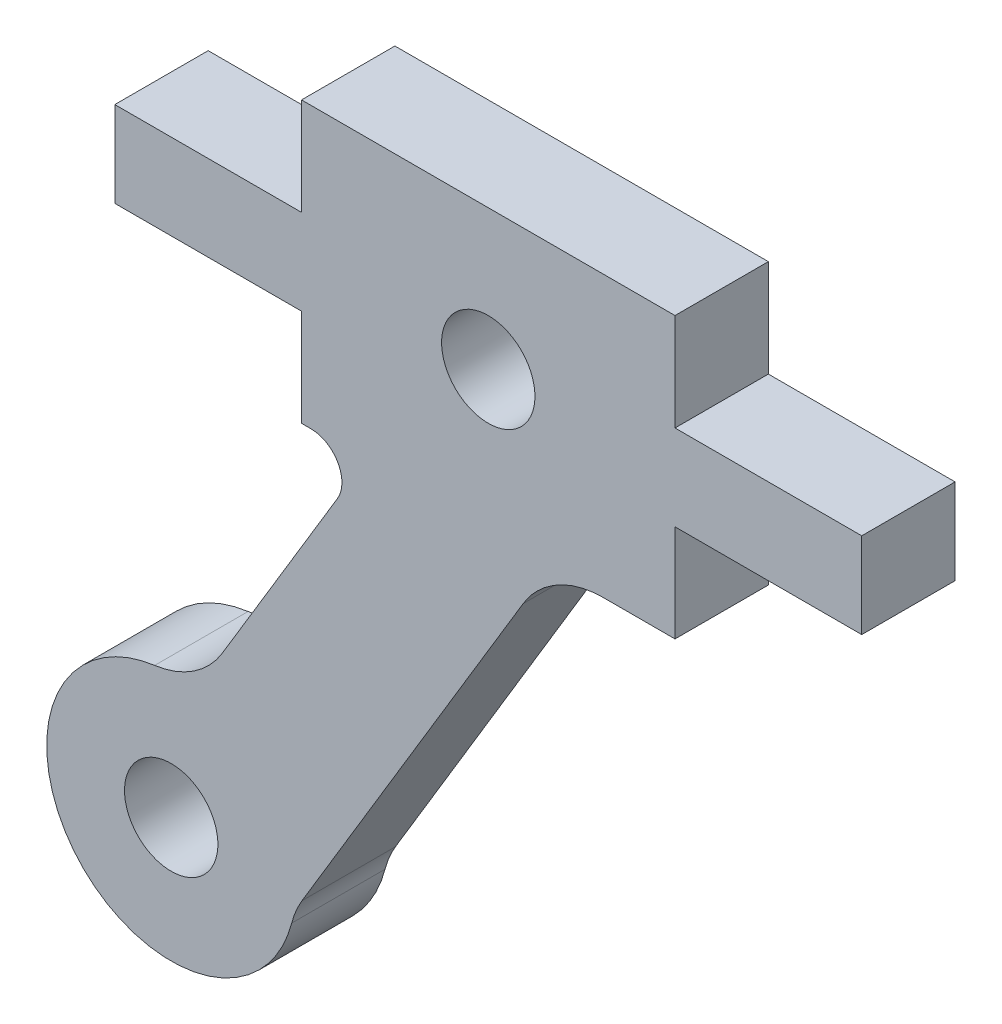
ISO-10303-21;
HEADER;
FILE_DESCRIPTION(('STEP AP214'),'2;1');
FILE_NAME('part.step','',(''),(''),'','','');
FILE_SCHEMA(('AUTOMOTIVE_DESIGN { 1 0 10303 214 1 1 1 1 }'));
ENDSEC;
DATA;
#1=APPLICATION_CONTEXT('core data for automotive mechanical design processes');
#2=APPLICATION_PROTOCOL_DEFINITION('international standard','automotive_design',2000,#1);
#3=PRODUCT_CONTEXT('',#1,'mechanical');
#4=PRODUCT('Part','Part','',(#3));
#5=PRODUCT_RELATED_PRODUCT_CATEGORY('part','',(#4));
#6=PRODUCT_DEFINITION_FORMATION('','',#4);
#7=PRODUCT_DEFINITION_CONTEXT('part definition',#1,'design');
#8=PRODUCT_DEFINITION('design','',#6,#7);
#9=PRODUCT_DEFINITION_SHAPE('','',#8);
#10=(LENGTH_UNIT() NAMED_UNIT(*) SI_UNIT(.MILLI.,.METRE.));
#11=(NAMED_UNIT(*) PLANE_ANGLE_UNIT() SI_UNIT($,.RADIAN.));
#12=(NAMED_UNIT(*) SI_UNIT($,.STERADIAN.) SOLID_ANGLE_UNIT());
#13=UNCERTAINTY_MEASURE_WITH_UNIT(LENGTH_MEASURE(1.E-05),#10,'distance_accuracy_value','');
#14=(GEOMETRIC_REPRESENTATION_CONTEXT(3) GLOBAL_UNCERTAINTY_ASSIGNED_CONTEXT((#13)) GLOBAL_UNIT_ASSIGNED_CONTEXT((#10,
#11,#12)) REPRESENTATION_CONTEXT('',''));
#15=CARTESIAN_POINT('',(0.,0.,0.));
#16=DIRECTION('',(0.,0.,1.));
#17=DIRECTION('',(1.,0.,0.));
#18=AXIS2_PLACEMENT_3D('',#15,#16,#17);
#19=CARTESIAN_POINT('',(4.75049847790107,-6.43548992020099,0.));
#20=DIRECTION('',(0.,0.,-1.));
#21=DIRECTION('',(-1.,0.,0.));
#22=AXIS2_PLACEMENT_3D('',#19,#20,#21);
#23=CYLINDRICAL_SURFACE('',#22,3.);
#24=DIRECTION('',(0.,0.,1.));
#25=VECTOR('',#24,1.);
#26=CARTESIAN_POINT('',(2.17941508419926,-4.88967939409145,0.));
#27=LINE('',#26,#25);
#28=CARTESIAN_POINT('',(2.17941508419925,-4.88967939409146,0.));
#29=VERTEX_POINT('',#28);
#30=CARTESIAN_POINT('',(2.17941508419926,-4.88967939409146,-3.));
#31=VERTEX_POINT('',#30);
#32=EDGE_CURVE('E310',#29,#31,#27,.F.);
#33=ORIENTED_EDGE('',*,*,#32,.T.);
#34=CARTESIAN_POINT('',(4.75049847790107,-6.43548992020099,-3.));
#35=DIRECTION('',(0.,0.,-1.));
#36=DIRECTION('',(-1.,0.,0.));
#37=AXIS2_PLACEMENT_3D('',#34,#35,#36);
#38=CIRCLE('',#37,3.);
#39=CARTESIAN_POINT('',(2.62147831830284,-4.32189744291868,-3.));
#40=VERTEX_POINT('',#39);
#41=EDGE_CURVE('E263',#40,#31,#38,.F.);
#42=ORIENTED_EDGE('',*,*,#41,.F.);
#43=DIRECTION('',(0.,0.,-1.));
#44=VECTOR('',#43,1.);
#45=CARTESIAN_POINT('',(2.62147831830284,-4.32189744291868,0.));
#46=LINE('',#45,#44);
#47=CARTESIAN_POINT('',(2.62147831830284,-4.32189744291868,0.));
#48=VERTEX_POINT('',#47);
#49=EDGE_CURVE('E316',#40,#48,#46,.F.);
#50=ORIENTED_EDGE('',*,*,#49,.T.);
#51=CARTESIAN_POINT('',(4.75049847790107,-6.43548992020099,0.));
#52=DIRECTION('',(0.,0.,-1.));
#53=DIRECTION('',(-1.,0.,0.));
#54=AXIS2_PLACEMENT_3D('',#51,#52,#53);
#55=CIRCLE('',#54,3.);
#56=EDGE_CURVE('E400',#48,#29,#55,.F.);
#57=ORIENTED_EDGE('',*,*,#56,.T.);
#58=EDGE_LOOP('',(#33,#42,#50,#57));
#59=FACE_BOUND('',#58,.T.);
#60=ADVANCED_FACE('F31',(#59),#23,.F.);
#61=CARTESIAN_POINT('',(-2.357043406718,-18.2571734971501,0.));
#62=DIRECTION('',(0.,0.,-1.));
#63=DIRECTION('',(-1.,0.,0.));
#64=AXIS2_PLACEMENT_3D('',#61,#62,#63);
#65=CYLINDRICAL_SURFACE('',#64,3.);
#66=CARTESIAN_POINT('',(-2.357043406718,-18.2571734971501,0.));
#67=DIRECTION('',(0.,0.,-1.));
#68=DIRECTION('',(-1.,0.,0.));
#69=AXIS2_PLACEMENT_3D('',#66,#67,#68);
#70=CIRCLE('',#69,3.);
#71=CARTESIAN_POINT('',(-4.92812680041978,-16.7113629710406,0.));
#72=VERTEX_POINT('',#71);
#73=CARTESIAN_POINT('',(-5.26050047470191,-17.5022317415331,0.));
#74=VERTEX_POINT('',#73);
#75=EDGE_CURVE('E398',#72,#74,#70,.F.);
#76=ORIENTED_EDGE('',*,*,#75,.T.);
#77=DIRECTION('',(0.,0.,-1.));
#78=VECTOR('',#77,1.);
#79=CARTESIAN_POINT('',(-5.26050047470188,-17.5022317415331,0.));
#80=LINE('',#79,#78);
#81=CARTESIAN_POINT('',(-5.26050047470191,-17.5022317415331,-3.));
#82=VERTEX_POINT('',#81);
#83=EDGE_CURVE('E307',#82,#74,#80,.F.);
#84=ORIENTED_EDGE('',*,*,#83,.F.);
#85=CARTESIAN_POINT('',(-2.357043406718,-18.2571734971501,-3.));
#86=DIRECTION('',(0.,0.,-1.));
#87=DIRECTION('',(-1.,0.,0.));
#88=AXIS2_PLACEMENT_3D('',#85,#86,#87);
#89=CIRCLE('',#88,3.);
#90=CARTESIAN_POINT('',(-4.92812680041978,-16.7113629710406,-3.));
#91=VERTEX_POINT('',#90);
#92=EDGE_CURVE('E403',#91,#82,#89,.F.);
#93=ORIENTED_EDGE('',*,*,#92,.F.);
#94=DIRECTION('',(0.,0.,1.));
#95=VECTOR('',#94,1.);
#96=CARTESIAN_POINT('',(-4.92812680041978,-16.7113629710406,0.));
#97=LINE('',#96,#95);
#98=EDGE_CURVE('E314',#91,#72,#97,.T.);
#99=ORIENTED_EDGE('',*,*,#98,.T.);
#100=EDGE_LOOP('',(#76,#84,#93,#99));
#101=FACE_BOUND('',#100,.T.);
#102=ADVANCED_FACE('F693',(#101),#65,.F.);
#103=CARTESIAN_POINT('',(-4.64573100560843,-3.43548992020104,0.));
#104=DIRECTION('',(0.,1.,0.));
#105=DIRECTION('',(-1.,0.,0.));
#106=AXIS2_PLACEMENT_3D('',#103,#104,#105);
#107=PLANE('',#106);
#108=DIRECTION('',(-1.,0.,0.));
#109=VECTOR('',#108,1.);
#110=CARTESIAN_POINT('',(4.75049847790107,-3.43548992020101,0.));
#111=LINE('',#110,#109);
#112=CARTESIAN_POINT('',(-4.64573100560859,-3.435489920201,0.));
#113=VERTEX_POINT('',#112);
#114=CARTESIAN_POINT('',(-4.94320376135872,-3.43548992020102,0.));
#115=VERTEX_POINT('',#114);
#116=EDGE_CURVE('E397',#113,#115,#111,.T.);
#117=ORIENTED_EDGE('',*,*,#116,.T.);
#118=DIRECTION('',(0.,0.,1.));
#119=VECTOR('',#118,1.);
#120=CARTESIAN_POINT('',(-4.94320376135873,-3.43548992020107,0.));
#121=LINE('',#120,#119);
#122=CARTESIAN_POINT('',(-4.94320376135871,-3.43548992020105,-3.));
#123=VERTEX_POINT('',#122);
#124=EDGE_CURVE('E348',#115,#123,#121,.F.);
#125=ORIENTED_EDGE('',*,*,#124,.T.);
#126=DIRECTION('',(-1.,0.,0.));
#127=VECTOR('',#126,1.);
#128=CARTESIAN_POINT('',(-4.64573100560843,-3.43548992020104,-3.));
#129=LINE('',#128,#127);
#130=CARTESIAN_POINT('',(-4.64573100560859,-3.43548992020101,-3.));
#131=VERTEX_POINT('',#130);
#132=EDGE_CURVE('E402',#131,#123,#129,.T.);
#133=ORIENTED_EDGE('',*,*,#132,.F.);
#134=DIRECTION('',(0.,0.,-1.));
#135=VECTOR('',#134,1.);
#136=CARTESIAN_POINT('',(-4.6457310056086,-3.43548992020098,0.));
#137=LINE('',#136,#135);
#138=EDGE_CURVE('E290',#131,#113,#137,.F.);
#139=ORIENTED_EDGE('',*,*,#138,.T.);
#140=EDGE_LOOP('',(#117,#125,#133,#139));
#141=FACE_BOUND('',#140,.T.);
#142=ADVANCED_FACE('F703',(#141),#107,.F.);
#143=CARTESIAN_POINT('',(4.75049847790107,-6.43548992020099,0.));
#144=DIRECTION('',(0.,0.,-1.));
#145=DIRECTION('',(-1.,0.,0.));
#146=AXIS2_PLACEMENT_3D('',#143,#144,#145);
#147=PLANE('',#146);
#148=CARTESIAN_POINT('',(1.05679623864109,1.06451007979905,0.));
#149=DIRECTION('',(0.,0.,-1.));
#150=DIRECTION('',(-1.,0.,0.));
#151=AXIS2_PLACEMENT_3D('',#148,#149,#150);
#152=CIRCLE('',#151,1.49999999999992);
#153=CARTESIAN_POINT('',(2.12130631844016,0.00771384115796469,0.));
#154=VERTEX_POINT('',#153);
#155=CARTESIAN_POINT('',(-0.00771384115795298,2.12130631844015,0.));
#156=VERTEX_POINT('',#155);
#157=EDGE_CURVE('E282',#154,#156,#152,.T.);
#158=ORIENTED_EDGE('',*,*,#157,.T.);
#159=CARTESIAN_POINT('',(1.05679623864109,1.06451007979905,0.));
#160=DIRECTION('',(0.,0.,-1.));
#161=DIRECTION('',(-1.,0.,0.));
#162=AXIS2_PLACEMENT_3D('',#159,#160,#161);
#163=CIRCLE('',#162,1.49999999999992);
#164=EDGE_CURVE('E285',#156,#154,#163,.T.);
#165=ORIENTED_EDGE('',*,*,#164,.T.);
#166=EDGE_LOOP('',(#158,#165));
#167=FACE_BOUND('',#166,.T.);
#168=DIRECTION('',(0.,-1.,0.));
#169=VECTOR('',#168,1.);
#170=CARTESIAN_POINT('',(7.05679623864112,-0.435489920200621,0.));
#171=LINE('',#170,#169);
#172=CARTESIAN_POINT('',(7.05679623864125,-3.43548992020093,0.));
#173=VERTEX_POINT('',#172);
#174=CARTESIAN_POINT('',(7.05679623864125,-0.315,0.));
#175=VERTEX_POINT('',#174);
#176=EDGE_CURVE('E213',#173,#175,#171,.F.);
#177=ORIENTED_EDGE('',*,*,#176,.T.);
#178=DIRECTION('',(-1.,0.,0.));
#179=VECTOR('',#178,1.);
#180=CARTESIAN_POINT('',(7.05679623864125,-0.315,0.));
#181=LINE('',#180,#179);
#182=CARTESIAN_POINT('',(13.0567962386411,-0.315,0.));
#183=VERTEX_POINT('',#182);
#184=EDGE_CURVE('E217',#183,#175,#181,.T.);
#185=ORIENTED_EDGE('',*,*,#184,.F.);
#186=DIRECTION('',(0.,-1.,0.));
#187=VECTOR('',#186,1.);
#188=CARTESIAN_POINT('',(13.0567962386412,2.56451007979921,0.));
#189=LINE('',#188,#187);
#190=CARTESIAN_POINT('',(13.0567962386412,2.435,0.));
#191=VERTEX_POINT('',#190);
#192=EDGE_CURVE('E34',#183,#191,#189,.F.);
#193=ORIENTED_EDGE('',*,*,#192,.T.);
#194=DIRECTION('',(1.,0.,0.));
#195=VECTOR('',#194,1.);
#196=CARTESIAN_POINT('',(7.05679623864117,2.435,0.));
#197=LINE('',#196,#195);
#198=CARTESIAN_POINT('',(7.05679623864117,2.435,0.));
#199=VERTEX_POINT('',#198);
#200=EDGE_CURVE('E232',#199,#191,#197,.T.);
#201=ORIENTED_EDGE('',*,*,#200,.F.);
#202=DIRECTION('',(0.,-1.,0.));
#203=VECTOR('',#202,1.);
#204=CARTESIAN_POINT('',(7.05679623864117,5.56451007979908,0.));
#205=LINE('',#204,#203);
#206=CARTESIAN_POINT('',(7.05679623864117,5.56451007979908,0.));
#207=VERTEX_POINT('',#206);
#208=EDGE_CURVE('E438',#199,#207,#205,.F.);
#209=ORIENTED_EDGE('',*,*,#208,.T.);
#210=DIRECTION('',(1.,0.,0.));
#211=VECTOR('',#210,1.);
#212=CARTESIAN_POINT('',(7.05679623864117,5.56451007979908,0.));
#213=LINE('',#212,#211);
#214=CARTESIAN_POINT('',(-4.94320376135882,5.56451007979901,0.));
#215=VERTEX_POINT('',#214);
#216=EDGE_CURVE('E444',#207,#215,#213,.F.);
#217=ORIENTED_EDGE('',*,*,#216,.T.);
#218=DIRECTION('',(0.,1.,0.));
#219=VECTOR('',#218,1.);
#220=CARTESIAN_POINT('',(-4.94320376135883,5.564510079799,0.));
#221=LINE('',#220,#219);
#222=CARTESIAN_POINT('',(-4.94320376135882,2.435,0.));
#223=VERTEX_POINT('',#222);
#224=EDGE_CURVE('E340',#215,#223,#221,.F.);
#225=ORIENTED_EDGE('',*,*,#224,.T.);
#226=DIRECTION('',(1.,0.,0.));
#227=VECTOR('',#226,1.);
#228=CARTESIAN_POINT('',(-4.94320376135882,2.435,0.));
#229=LINE('',#228,#227);
#230=CARTESIAN_POINT('',(-10.9432037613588,2.435,0.));
#231=VERTEX_POINT('',#230);
#232=EDGE_CURVE('E242',#231,#223,#229,.T.);
#233=ORIENTED_EDGE('',*,*,#232,.F.);
#234=DIRECTION('',(0.,1.,0.));
#235=VECTOR('',#234,1.);
#236=CARTESIAN_POINT('',(-10.9432037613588,2.56451007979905,0.));
#237=LINE('',#236,#235);
#238=CARTESIAN_POINT('',(-10.9432037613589,-0.315,0.));
#239=VERTEX_POINT('',#238);
#240=EDGE_CURVE('E337',#231,#239,#237,.F.);
#241=ORIENTED_EDGE('',*,*,#240,.T.);
#242=DIRECTION('',(-1.,0.,0.));
#243=VECTOR('',#242,1.);
#244=CARTESIAN_POINT('',(-4.94320376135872,-0.315,0.));
#245=LINE('',#244,#243);
#246=CARTESIAN_POINT('',(-4.94320376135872,-0.315,0.));
#247=VERTEX_POINT('',#246);
#248=EDGE_CURVE('E251',#247,#239,#245,.T.);
#249=ORIENTED_EDGE('',*,*,#248,.F.);
#250=DIRECTION('',(0.,1.,0.));
#251=VECTOR('',#250,1.);
#252=CARTESIAN_POINT('',(-4.94320376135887,-0.435489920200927,0.));
#253=LINE('',#252,#251);
#254=EDGE_CURVE('E288',#247,#115,#253,.F.);
#255=ORIENTED_EDGE('',*,*,#254,.T.);
#256=ORIENTED_EDGE('',*,*,#116,.F.);
#257=CARTESIAN_POINT('',(-4.64573100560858,-4.43548992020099,0.));
#258=DIRECTION('',(0.,0.,-1.));
#259=DIRECTION('',(-1.,0.,0.));
#260=AXIS2_PLACEMENT_3D('',#257,#258,#259);
#261=CIRCLE('',#260,1.);
#262=CARTESIAN_POINT('',(-3.78874025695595,-4.95082171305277,0.));
#263=VERTEX_POINT('',#262);
#264=EDGE_CURVE('E289',#113,#263,#261,.T.);
#265=ORIENTED_EDGE('',*,*,#264,.T.);
#266=DIRECTION('',(0.515331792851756,0.85699074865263,0.));
#267=VECTOR('',#266,1.);
#268=CARTESIAN_POINT('',(-7.4884374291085,-11.1033748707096,0.));
#269=LINE('',#268,#267);
#270=CARTESIAN_POINT('',(-7.48843742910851,-11.1033748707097,0.));
#271=VERTEX_POINT('',#270);
#272=EDGE_CURVE('E294',#263,#271,#269,.F.);
#273=ORIENTED_EDGE('',*,*,#272,.T.);
#274=CARTESIAN_POINT('',(-10.0594096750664,-9.55737949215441,0.));
#275=DIRECTION('',(0.,0.,-1.));
#276=DIRECTION('',(-1.,0.,0.));
#277=AXIS2_PLACEMENT_3D('',#274,#275,#276);
#278=CIRCLE('',#277,3.);
#279=CARTESIAN_POINT('',(-9.66185262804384,-12.5309208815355,0.));
#280=VERTEX_POINT('',#279);
#281=EDGE_CURVE('E297',#271,#280,#278,.T.);
#282=ORIENTED_EDGE('',*,*,#281,.T.);
#283=CARTESIAN_POINT('',(-9.1317765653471,-16.4956427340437,0.));
#284=DIRECTION('',(0.,0.,-1.));
#285=DIRECTION('',(-1.,0.,0.));
#286=AXIS2_PLACEMENT_3D('',#283,#284,#285);
#287=CIRCLE('',#286,3.99999999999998);
#288=CARTESIAN_POINT('',(-11.970470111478,-13.6775194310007,0.));
#289=VERTEX_POINT('',#288);
#290=EDGE_CURVE('E301',#289,#280,#287,.T.);
#291=ORIENTED_EDGE('',*,*,#290,.F.);
#292=CARTESIAN_POINT('',(-9.1317765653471,-16.4956427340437,0.));
#293=DIRECTION('',(0.,0.,-1.));
#294=DIRECTION('',(-1.,0.,0.));
#295=AXIS2_PLACEMENT_3D('',#292,#293,#294);
#296=CIRCLE('',#295,3.99999999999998);
#297=CARTESIAN_POINT('',(-6.29308301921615,-19.3137660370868,0.));
#298=VERTEX_POINT('',#297);
#299=EDGE_CURVE('E302',#298,#289,#296,.T.);
#300=ORIENTED_EDGE('',*,*,#299,.F.);
#301=CARTESIAN_POINT('',(-9.1317765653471,-16.4956427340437,0.));
#302=DIRECTION('',(0.,0.,-1.));
#303=DIRECTION('',(-1.,0.,0.));
#304=AXIS2_PLACEMENT_3D('',#301,#302,#303);
#305=CIRCLE('',#304,3.99999999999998);
#306=EDGE_CURVE('E306',#74,#298,#305,.T.);
#307=ORIENTED_EDGE('',*,*,#306,.F.);
#308=ORIENTED_EDGE('',*,*,#75,.F.);
#309=DIRECTION('',(-0.515270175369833,-0.857027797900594,0.));
#310=VECTOR('',#309,1.);
#311=CARTESIAN_POINT('',(-4.92812680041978,-16.7113629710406,0.));
#312=LINE('',#311,#310);
#313=EDGE_CURVE('E313',#72,#29,#312,.F.);
#314=ORIENTED_EDGE('',*,*,#313,.T.);
#315=ORIENTED_EDGE('',*,*,#56,.F.);
#316=CARTESIAN_POINT('',(4.75049847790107,-6.43548992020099,0.));
#317=DIRECTION('',(0.,0.,-1.));
#318=DIRECTION('',(-1.,0.,0.));
#319=AXIS2_PLACEMENT_3D('',#316,#317,#318);
#320=CIRCLE('',#319,3.);
#321=CARTESIAN_POINT('',(4.75049847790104,-3.43548992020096,0.));
#322=VERTEX_POINT('',#321);
#323=EDGE_CURVE('E319',#48,#322,#320,.T.);
#324=ORIENTED_EDGE('',*,*,#323,.T.);
#325=DIRECTION('',(-1.,0.,0.));
#326=VECTOR('',#325,1.);
#327=CARTESIAN_POINT('',(7.05679623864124,-3.43548992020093,0.));
#328=LINE('',#327,#326);
#329=EDGE_CURVE('E220',#322,#173,#328,.F.);
#330=ORIENTED_EDGE('',*,*,#329,.T.);
#331=EDGE_LOOP('',(#177,#185,#193,#201,#209,#217,#225,#233,#241,#249,#255,#256,#265,#273,#282,
#291,#300,#307,#308,#314,#315,#324,#330));
#332=FACE_BOUND('',#331,.T.);
#333=CARTESIAN_POINT('',(-9.1317765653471,-16.4956427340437,0.));
#334=DIRECTION('',(0.,0.,-1.));
#335=DIRECTION('',(-1.,0.,0.));
#336=AXIS2_PLACEMENT_3D('',#333,#334,#335);
#337=CIRCLE('',#336,1.5);
#338=CARTESIAN_POINT('',(-8.06726648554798,-17.5524389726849,0.));
#339=VERTEX_POINT('',#338);
#340=CARTESIAN_POINT('',(-10.1962866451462,-15.4388464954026,0.));
#341=VERTEX_POINT('',#340);
#342=EDGE_CURVE('E394',#339,#341,#337,.T.);
#343=ORIENTED_EDGE('',*,*,#342,.T.);
#344=CARTESIAN_POINT('',(-9.1317765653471,-16.4956427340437,0.));
#345=DIRECTION('',(0.,0.,-1.));
#346=DIRECTION('',(-1.,0.,0.));
#347=AXIS2_PLACEMENT_3D('',#344,#345,#346);
#348=CIRCLE('',#347,1.5);
#349=EDGE_CURVE('E341',#341,#339,#348,.T.);
#350=ORIENTED_EDGE('',*,*,#349,.T.);
#351=EDGE_LOOP('',(#343,#350));
#352=FACE_BOUND('',#351,.T.);
#353=ADVANCED_FACE('F215',(#167,#332,#352),#147,.F.);
#354=CARTESIAN_POINT('',(-9.1317765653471,-16.4956427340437,0.));
#355=DIRECTION('',(0.,0.,-1.));
#356=DIRECTION('',(-1.,0.,0.));
#357=AXIS2_PLACEMENT_3D('',#354,#355,#356);
#358=CYLINDRICAL_SURFACE('',#357,1.5);
#359=CARTESIAN_POINT('',(-9.1317765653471,-16.4956427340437,-3.));
#360=DIRECTION('',(0.,0.,-1.));
#361=DIRECTION('',(-1.,0.,0.));
#362=AXIS2_PLACEMENT_3D('',#359,#360,#361);
#363=CIRCLE('',#362,1.5);
#364=CARTESIAN_POINT('',(-10.1962866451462,-15.4388464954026,-3.));
#365=VERTEX_POINT('',#364);
#366=CARTESIAN_POINT('',(-8.06726648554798,-17.5524389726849,-3.));
#367=VERTEX_POINT('',#366);
#368=EDGE_CURVE('E378',#365,#367,#363,.F.);
#369=ORIENTED_EDGE('',*,*,#368,.F.);
#370=DIRECTION('',(0.,0.,-1.));
#371=VECTOR('',#370,1.);
#372=CARTESIAN_POINT('',(-10.1962866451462,-15.4388464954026,0.));
#373=LINE('',#372,#371);
#374=EDGE_CURVE('E393',#365,#341,#373,.F.);
#375=ORIENTED_EDGE('',*,*,#374,.T.);
#376=ORIENTED_EDGE('',*,*,#342,.F.);
#377=DIRECTION('',(0.,0.,-1.));
#378=VECTOR('',#377,1.);
#379=CARTESIAN_POINT('',(-8.06726648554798,-17.5524389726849,0.));
#380=LINE('',#379,#378);
#381=EDGE_CURVE('E396',#339,#367,#380,.T.);
#382=ORIENTED_EDGE('',*,*,#381,.T.);
#383=EDGE_LOOP('',(#369,#375,#376,#382));
#384=FACE_BOUND('',#383,.T.);
#385=ADVANCED_FACE('F721',(#384),#358,.F.);
#386=CARTESIAN_POINT('',(-9.1317765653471,-16.4956427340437,0.));
#387=DIRECTION('',(0.,0.,-1.));
#388=DIRECTION('',(-1.,0.,0.));
#389=AXIS2_PLACEMENT_3D('',#386,#387,#388);
#390=CYLINDRICAL_SURFACE('',#389,1.5);
#391=ORIENTED_EDGE('',*,*,#374,.F.);
#392=CARTESIAN_POINT('',(-9.1317765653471,-16.4956427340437,-3.));
#393=DIRECTION('',(0.,0.,-1.));
#394=DIRECTION('',(-1.,0.,0.));
#395=AXIS2_PLACEMENT_3D('',#392,#393,#394);
#396=CIRCLE('',#395,1.5);
#397=EDGE_CURVE('E374',#367,#365,#396,.F.);
#398=ORIENTED_EDGE('',*,*,#397,.F.);
#399=ORIENTED_EDGE('',*,*,#381,.F.);
#400=ORIENTED_EDGE('',*,*,#349,.F.);
#401=EDGE_LOOP('',(#391,#398,#399,#400));
#402=FACE_BOUND('',#401,.T.);
#403=ADVANCED_FACE('F729',(#402),#390,.F.);
#404=CARTESIAN_POINT('',(-10.9432037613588,2.56451007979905,0.));
#405=DIRECTION('',(1.,0.,0.));
#406=DIRECTION('',(0.,1.,0.));
#407=AXIS2_PLACEMENT_3D('',#404,#405,#406);
#408=PLANE('',#407);
#409=ORIENTED_EDGE('',*,*,#240,.F.);
#410=DIRECTION('',(0.,0.,-1.));
#411=VECTOR('',#410,1.);
#412=CARTESIAN_POINT('',(-10.9432037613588,2.435,0.));
#413=LINE('',#412,#411);
#414=CARTESIAN_POINT('',(-10.9432037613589,2.435,-3.));
#415=VERTEX_POINT('',#414);
#416=EDGE_CURVE('E248',#231,#415,#413,.T.);
#417=ORIENTED_EDGE('',*,*,#416,.T.);
#418=DIRECTION('',(0.,1.,0.));
#419=VECTOR('',#418,1.);
#420=CARTESIAN_POINT('',(-10.9432037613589,-6.43548992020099,-3.));
#421=LINE('',#420,#419);
#422=CARTESIAN_POINT('',(-10.9432037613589,-0.315,-3.));
#423=VERTEX_POINT('',#422);
#424=EDGE_CURVE('E377',#423,#415,#421,.T.);
#425=ORIENTED_EDGE('',*,*,#424,.F.);
#426=DIRECTION('',(0.,0.,1.));
#427=VECTOR('',#426,1.);
#428=CARTESIAN_POINT('',(-10.9432037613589,-0.315,0.));
#429=LINE('',#428,#427);
#430=EDGE_CURVE('E260',#423,#239,#429,.T.);
#431=ORIENTED_EDGE('',*,*,#430,.T.);
#432=EDGE_LOOP('',(#409,#417,#425,#431));
#433=FACE_BOUND('',#432,.T.);
#434=ADVANCED_FACE('F494',(#433),#408,.F.);
#435=CARTESIAN_POINT('',(-4.94320376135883,5.564510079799,0.));
#436=DIRECTION('',(1.,0.,0.));
#437=DIRECTION('',(0.,1.,0.));
#438=AXIS2_PLACEMENT_3D('',#435,#436,#437);
#439=PLANE('',#438);
#440=ORIENTED_EDGE('',*,*,#224,.F.);
#441=DIRECTION('',(0.,0.,1.));
#442=VECTOR('',#441,1.);
#443=CARTESIAN_POINT('',(-4.94320376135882,5.56451007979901,0.));
#444=LINE('',#443,#442);
#445=CARTESIAN_POINT('',(-4.94320376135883,5.564510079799,-3.));
#446=VERTEX_POINT('',#445);
#447=EDGE_CURVE('E441',#215,#446,#444,.F.);
#448=ORIENTED_EDGE('',*,*,#447,.T.);
#449=DIRECTION('',(0.,1.,0.));
#450=VECTOR('',#449,1.);
#451=CARTESIAN_POINT('',(-4.94320376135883,-6.43548992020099,-3.));
#452=LINE('',#451,#450);
#453=CARTESIAN_POINT('',(-4.94320376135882,2.435,-3.));
#454=VERTEX_POINT('',#453);
#455=EDGE_CURVE('E407',#454,#446,#452,.T.);
#456=ORIENTED_EDGE('',*,*,#455,.F.);
#457=DIRECTION('',(0.,0.,1.));
#458=VECTOR('',#457,1.);
#459=CARTESIAN_POINT('',(-4.94320376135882,2.435,-3.));
#460=LINE('',#459,#458);
#461=EDGE_CURVE('E245',#454,#223,#460,.T.);
#462=ORIENTED_EDGE('',*,*,#461,.T.);
#463=EDGE_LOOP('',(#440,#448,#456,#462));
#464=FACE_BOUND('',#463,.T.);
#465=ADVANCED_FACE('F457',(#464),#439,.F.);
#466=CARTESIAN_POINT('',(7.05679623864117,5.56451007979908,0.));
#467=DIRECTION('',(0.,-1.,0.));
#468=DIRECTION('',(1.,0.,0.));
#469=AXIS2_PLACEMENT_3D('',#466,#467,#468);
#470=PLANE('',#469);
#471=ORIENTED_EDGE('',*,*,#216,.F.);
#472=DIRECTION('',(0.,0.,1.));
#473=VECTOR('',#472,1.);
#474=CARTESIAN_POINT('',(7.05679623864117,5.56451007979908,0.));
#475=LINE('',#474,#473);
#476=CARTESIAN_POINT('',(7.05679623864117,5.56451007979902,-3.));
#477=VERTEX_POINT('',#476);
#478=EDGE_CURVE('E440',#207,#477,#475,.F.);
#479=ORIENTED_EDGE('',*,*,#478,.T.);
#480=DIRECTION('',(-1.,0.,0.));
#481=VECTOR('',#480,1.);
#482=CARTESIAN_POINT('',(4.75049847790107,5.564510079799,-3.));
#483=LINE('',#482,#481);
#484=EDGE_CURVE('E462',#446,#477,#483,.F.);
#485=ORIENTED_EDGE('',*,*,#484,.F.);
#486=ORIENTED_EDGE('',*,*,#447,.F.);
#487=EDGE_LOOP('',(#471,#479,#485,#486));
#488=FACE_BOUND('',#487,.T.);
#489=ADVANCED_FACE('F486',(#488),#470,.F.);
#490=CARTESIAN_POINT('',(7.05679623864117,5.56451007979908,0.));
#491=DIRECTION('',(-1.,0.,0.));
#492=DIRECTION('',(0.,-1.,0.));
#493=AXIS2_PLACEMENT_3D('',#490,#491,#492);
#494=PLANE('',#493);
#495=ORIENTED_EDGE('',*,*,#208,.F.);
#496=DIRECTION('',(0.,0.,1.));
#497=VECTOR('',#496,1.);
#498=CARTESIAN_POINT('',(7.05679623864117,2.435,-3.));
#499=LINE('',#498,#497);
#500=CARTESIAN_POINT('',(7.05679623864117,2.435,-3.));
#501=VERTEX_POINT('',#500);
#502=EDGE_CURVE('E237',#501,#199,#499,.T.);
#503=ORIENTED_EDGE('',*,*,#502,.F.);
#504=DIRECTION('',(0.,1.,0.));
#505=VECTOR('',#504,1.);
#506=CARTESIAN_POINT('',(7.05679623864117,-6.43548992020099,-3.));
#507=LINE('',#506,#505);
#508=EDGE_CURVE('E332',#477,#501,#507,.F.);
#509=ORIENTED_EDGE('',*,*,#508,.F.);
#510=ORIENTED_EDGE('',*,*,#478,.F.);
#511=EDGE_LOOP('',(#495,#503,#509,#510));
#512=FACE_BOUND('',#511,.T.);
#513=ADVANCED_FACE('F485',(#512),#494,.F.);
#514=CARTESIAN_POINT('',(13.0567962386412,2.56451007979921,0.));
#515=DIRECTION('',(-1.,0.,0.));
#516=DIRECTION('',(0.,-1.,0.));
#517=AXIS2_PLACEMENT_3D('',#514,#515,#516);
#518=PLANE('',#517);
#519=ORIENTED_EDGE('',*,*,#192,.F.);
#520=DIRECTION('',(0.,0.,-1.));
#521=VECTOR('',#520,1.);
#522=CARTESIAN_POINT('',(13.0567962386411,-0.315,0.));
#523=LINE('',#522,#521);
#524=CARTESIAN_POINT('',(13.0567962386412,-0.315,-3.));
#525=VERTEX_POINT('',#524);
#526=EDGE_CURVE('E228',#183,#525,#523,.T.);
#527=ORIENTED_EDGE('',*,*,#526,.T.);
#528=DIRECTION('',(0.,1.,0.));
#529=VECTOR('',#528,1.);
#530=CARTESIAN_POINT('',(13.0567962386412,-6.43548992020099,-3.));
#531=LINE('',#530,#529);
#532=CARTESIAN_POINT('',(13.0567962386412,2.435,-3.));
#533=VERTEX_POINT('',#532);
#534=EDGE_CURVE('E327',#533,#525,#531,.F.);
#535=ORIENTED_EDGE('',*,*,#534,.F.);
#536=DIRECTION('',(0.,0.,1.));
#537=VECTOR('',#536,1.);
#538=CARTESIAN_POINT('',(13.0567962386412,2.435,0.));
#539=LINE('',#538,#537);
#540=EDGE_CURVE('E55',#533,#191,#539,.T.);
#541=ORIENTED_EDGE('',*,*,#540,.T.);
#542=EDGE_LOOP('',(#519,#527,#535,#541));
#543=FACE_BOUND('',#542,.T.);
#544=ADVANCED_FACE('F481',(#543),#518,.F.);
#545=CARTESIAN_POINT('',(7.05679623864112,-0.435489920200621,0.));
#546=DIRECTION('',(-1.,0.,0.));
#547=DIRECTION('',(0.,-1.,0.));
#548=AXIS2_PLACEMENT_3D('',#545,#546,#547);
#549=PLANE('',#548);
#550=ORIENTED_EDGE('',*,*,#176,.F.);
#551=DIRECTION('',(0.,0.,1.));
#552=VECTOR('',#551,1.);
#553=CARTESIAN_POINT('',(7.05679623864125,-3.43548992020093,0.));
#554=LINE('',#553,#552);
#555=CARTESIAN_POINT('',(7.05679623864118,-3.43548992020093,-3.));
#556=VERTEX_POINT('',#555);
#557=EDGE_CURVE('E322',#173,#556,#554,.F.);
#558=ORIENTED_EDGE('',*,*,#557,.T.);
#559=DIRECTION('',(0.,1.,0.));
#560=VECTOR('',#559,1.);
#561=CARTESIAN_POINT('',(7.05679623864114,-6.43548992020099,-3.));
#562=LINE('',#561,#560);
#563=CARTESIAN_POINT('',(7.05679623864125,-0.315,-3.));
#564=VERTEX_POINT('',#563);
#565=EDGE_CURVE('E47',#564,#556,#562,.F.);
#566=ORIENTED_EDGE('',*,*,#565,.F.);
#567=DIRECTION('',(0.,0.,1.));
#568=VECTOR('',#567,1.);
#569=CARTESIAN_POINT('',(7.05679623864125,-0.315,-3.));
#570=LINE('',#569,#568);
#571=EDGE_CURVE('E225',#564,#175,#570,.T.);
#572=ORIENTED_EDGE('',*,*,#571,.T.);
#573=EDGE_LOOP('',(#550,#558,#566,#572));
#574=FACE_BOUND('',#573,.T.);
#575=ADVANCED_FACE('F230',(#574),#549,.F.);
#576=CARTESIAN_POINT('',(7.05679623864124,-3.43548992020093,0.));
#577=DIRECTION('',(0.,1.,0.));
#578=DIRECTION('',(-1.,0.,0.));
#579=AXIS2_PLACEMENT_3D('',#576,#577,#578);
#580=PLANE('',#579);
#581=ORIENTED_EDGE('',*,*,#329,.F.);
#582=DIRECTION('',(0.,0.,-1.));
#583=VECTOR('',#582,1.);
#584=CARTESIAN_POINT('',(4.75049847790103,-3.43548992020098,0.));
#585=LINE('',#584,#583);
#586=CARTESIAN_POINT('',(4.75049847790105,-3.43548992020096,-3.));
#587=VERTEX_POINT('',#586);
#588=EDGE_CURVE('E317',#322,#587,#585,.T.);
#589=ORIENTED_EDGE('',*,*,#588,.T.);
#590=DIRECTION('',(-1.,0.,0.));
#591=VECTOR('',#590,1.);
#592=CARTESIAN_POINT('',(4.75049847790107,-3.43548992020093,-3.));
#593=LINE('',#592,#591);
#594=EDGE_CURVE('E274',#556,#587,#593,.T.);
#595=ORIENTED_EDGE('',*,*,#594,.F.);
#596=ORIENTED_EDGE('',*,*,#557,.F.);
#597=EDGE_LOOP('',(#581,#589,#595,#596));
#598=FACE_BOUND('',#597,.T.);
#599=ADVANCED_FACE('F549',(#598),#580,.F.);
#600=CARTESIAN_POINT('',(4.75049847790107,-6.43548992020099,0.));
#601=DIRECTION('',(0.,0.,-1.));
#602=DIRECTION('',(-1.,0.,0.));
#603=AXIS2_PLACEMENT_3D('',#600,#601,#602);
#604=CYLINDRICAL_SURFACE('',#603,3.);
#605=CARTESIAN_POINT('',(4.75049847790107,-6.43548992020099,-3.));
#606=DIRECTION('',(0.,0.,-1.));
#607=DIRECTION('',(-1.,0.,0.));
#608=AXIS2_PLACEMENT_3D('',#605,#606,#607);
#609=CIRCLE('',#608,3.);
#610=EDGE_CURVE('E273',#587,#40,#609,.F.);
#611=ORIENTED_EDGE('',*,*,#610,.F.);
#612=ORIENTED_EDGE('',*,*,#588,.F.);
#613=ORIENTED_EDGE('',*,*,#323,.F.);
#614=ORIENTED_EDGE('',*,*,#49,.F.);
#615=EDGE_LOOP('',(#611,#612,#613,#614));
#616=FACE_BOUND('',#615,.T.);
#617=ADVANCED_FACE('F545',(#616),#604,.F.);
#618=CARTESIAN_POINT('',(-4.92812680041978,-16.7113629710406,0.));
#619=DIRECTION('',(-0.857027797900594,0.515270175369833,0.));
#620=DIRECTION('',(-0.515270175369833,-0.857027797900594,0.));
#621=AXIS2_PLACEMENT_3D('',#618,#619,#620);
#622=PLANE('',#621);
#623=ORIENTED_EDGE('',*,*,#313,.F.);
#624=ORIENTED_EDGE('',*,*,#98,.F.);
#625=DIRECTION('',(-0.515270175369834,-0.857027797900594,0.));
#626=VECTOR('',#625,1.);
#627=CARTESIAN_POINT('',(2.17941508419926,-4.88967939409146,-3.));
#628=LINE('',#627,#626);
#629=EDGE_CURVE('E269',#31,#91,#628,.T.);
#630=ORIENTED_EDGE('',*,*,#629,.F.);
#631=ORIENTED_EDGE('',*,*,#32,.F.);
#632=EDGE_LOOP('',(#623,#624,#630,#631));
#633=FACE_BOUND('',#632,.T.);
#634=ADVANCED_FACE('F541',(#633),#622,.F.);
#635=CARTESIAN_POINT('',(-9.1317765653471,-16.4956427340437,0.));
#636=DIRECTION('',(0.,0.,-1.));
#637=DIRECTION('',(-1.,0.,0.));
#638=AXIS2_PLACEMENT_3D('',#635,#636,#637);
#639=CYLINDRICAL_SURFACE('',#638,3.99999999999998);
#640=ORIENTED_EDGE('',*,*,#306,.T.);
#641=DIRECTION('',(0.,0.,-1.));
#642=VECTOR('',#641,1.);
#643=CARTESIAN_POINT('',(-6.29308301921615,-19.3137660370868,0.));
#644=LINE('',#643,#642);
#645=CARTESIAN_POINT('',(-6.29308301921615,-19.3137660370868,-3.));
#646=VERTEX_POINT('',#645);
#647=EDGE_CURVE('E303',#646,#298,#644,.F.);
#648=ORIENTED_EDGE('',*,*,#647,.F.);
#649=CARTESIAN_POINT('',(-9.1317765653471,-16.4956427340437,-3.));
#650=DIRECTION('',(0.,0.,-1.));
#651=DIRECTION('',(-1.,0.,0.));
#652=AXIS2_PLACEMENT_3D('',#649,#650,#651);
#653=CIRCLE('',#652,3.99999999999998);
#654=EDGE_CURVE('E272',#82,#646,#653,.T.);
#655=ORIENTED_EDGE('',*,*,#654,.F.);
#656=ORIENTED_EDGE('',*,*,#83,.T.);
#657=EDGE_LOOP('',(#640,#648,#655,#656));
#658=FACE_BOUND('',#657,.T.);
#659=ADVANCED_FACE('F537',(#658),#639,.T.);
#660=CARTESIAN_POINT('',(-9.1317765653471,-16.4956427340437,0.));
#661=DIRECTION('',(0.,0.,-1.));
#662=DIRECTION('',(-1.,0.,0.));
#663=AXIS2_PLACEMENT_3D('',#660,#661,#662);
#664=CYLINDRICAL_SURFACE('',#663,3.99999999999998);
#665=ORIENTED_EDGE('',*,*,#647,.T.);
#666=ORIENTED_EDGE('',*,*,#299,.T.);
#667=DIRECTION('',(0.,0.,-1.));
#668=VECTOR('',#667,1.);
#669=CARTESIAN_POINT('',(-11.970470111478,-13.6775194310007,0.));
#670=LINE('',#669,#668);
#671=CARTESIAN_POINT('',(-11.970470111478,-13.6775194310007,-3.));
#672=VERTEX_POINT('',#671);
#673=EDGE_CURVE('E298',#672,#289,#670,.F.);
#674=ORIENTED_EDGE('',*,*,#673,.F.);
#675=CARTESIAN_POINT('',(-9.1317765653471,-16.4956427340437,-3.));
#676=DIRECTION('',(0.,0.,-1.));
#677=DIRECTION('',(-1.,0.,0.));
#678=AXIS2_PLACEMENT_3D('',#675,#676,#677);
#679=CIRCLE('',#678,3.99999999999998);
#680=EDGE_CURVE('E367',#646,#672,#679,.T.);
#681=ORIENTED_EDGE('',*,*,#680,.F.);
#682=EDGE_LOOP('',(#665,#666,#674,#681));
#683=FACE_BOUND('',#682,.T.);
#684=ADVANCED_FACE('F533',(#683),#664,.T.);
#685=CARTESIAN_POINT('',(-9.1317765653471,-16.4956427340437,0.));
#686=DIRECTION('',(0.,0.,-1.));
#687=DIRECTION('',(-1.,0.,0.));
#688=AXIS2_PLACEMENT_3D('',#685,#686,#687);
#689=CYLINDRICAL_SURFACE('',#688,3.99999999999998);
#690=ORIENTED_EDGE('',*,*,#673,.T.);
#691=ORIENTED_EDGE('',*,*,#290,.T.);
#692=DIRECTION('',(0.,0.,-1.));
#693=VECTOR('',#692,1.);
#694=CARTESIAN_POINT('',(-9.66185262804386,-12.5309208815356,0.));
#695=LINE('',#694,#693);
#696=CARTESIAN_POINT('',(-9.66185262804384,-12.5309208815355,-3.));
#697=VERTEX_POINT('',#696);
#698=EDGE_CURVE('E295',#280,#697,#695,.T.);
#699=ORIENTED_EDGE('',*,*,#698,.T.);
#700=CARTESIAN_POINT('',(-9.1317765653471,-16.4956427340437,-3.));
#701=DIRECTION('',(0.,0.,-1.));
#702=DIRECTION('',(-1.,0.,0.));
#703=AXIS2_PLACEMENT_3D('',#700,#701,#702);
#704=CIRCLE('',#703,3.99999999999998);
#705=EDGE_CURVE('E364',#672,#697,#704,.T.);
#706=ORIENTED_EDGE('',*,*,#705,.F.);
#707=EDGE_LOOP('',(#690,#691,#699,#706));
#708=FACE_BOUND('',#707,.T.);
#709=ADVANCED_FACE('F529',(#708),#689,.T.);
#710=CARTESIAN_POINT('',(-10.0594096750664,-9.55737949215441,0.));
#711=DIRECTION('',(0.,0.,-1.));
#712=DIRECTION('',(-1.,0.,0.));
#713=AXIS2_PLACEMENT_3D('',#710,#711,#712);
#714=CYLINDRICAL_SURFACE('',#713,3.);
#715=ORIENTED_EDGE('',*,*,#281,.F.);
#716=DIRECTION('',(0.,0.,1.));
#717=VECTOR('',#716,1.);
#718=CARTESIAN_POINT('',(-7.4884374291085,-11.1033748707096,0.));
#719=LINE('',#718,#717);
#720=CARTESIAN_POINT('',(-7.48843742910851,-11.1033748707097,-3.));
#721=VERTEX_POINT('',#720);
#722=EDGE_CURVE('E292',#271,#721,#719,.F.);
#723=ORIENTED_EDGE('',*,*,#722,.T.);
#724=CARTESIAN_POINT('',(-10.0594096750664,-9.55737949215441,-3.));
#725=DIRECTION('',(0.,0.,-1.));
#726=DIRECTION('',(-1.,0.,0.));
#727=AXIS2_PLACEMENT_3D('',#724,#725,#726);
#728=CIRCLE('',#727,3.);
#729=EDGE_CURVE('E268',#697,#721,#728,.F.);
#730=ORIENTED_EDGE('',*,*,#729,.F.);
#731=ORIENTED_EDGE('',*,*,#698,.F.);
#732=EDGE_LOOP('',(#715,#723,#730,#731));
#733=FACE_BOUND('',#732,.T.);
#734=ADVANCED_FACE('F525',(#733),#714,.F.);
#735=CARTESIAN_POINT('',(-7.4884374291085,-11.1033748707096,0.));
#736=DIRECTION('',(0.85699074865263,-0.515331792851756,0.));
#737=DIRECTION('',(0.515331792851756,0.85699074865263,0.));
#738=AXIS2_PLACEMENT_3D('',#735,#736,#737);
#739=PLANE('',#738);
#740=ORIENTED_EDGE('',*,*,#272,.F.);
#741=DIRECTION('',(0.,0.,-1.));
#742=VECTOR('',#741,1.);
#743=CARTESIAN_POINT('',(-3.78874025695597,-4.95082171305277,0.));
#744=LINE('',#743,#742);
#745=CARTESIAN_POINT('',(-3.78874025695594,-4.95082171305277,-3.));
#746=VERTEX_POINT('',#745);
#747=EDGE_CURVE('E286',#263,#746,#744,.T.);
#748=ORIENTED_EDGE('',*,*,#747,.T.);
#749=DIRECTION('',(0.515331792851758,0.856990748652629,0.));
#750=VECTOR('',#749,1.);
#751=CARTESIAN_POINT('',(-7.48843742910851,-11.1033748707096,-3.));
#752=LINE('',#751,#750);
#753=EDGE_CURVE('E264',#721,#746,#752,.T.);
#754=ORIENTED_EDGE('',*,*,#753,.F.);
#755=ORIENTED_EDGE('',*,*,#722,.F.);
#756=EDGE_LOOP('',(#740,#748,#754,#755));
#757=FACE_BOUND('',#756,.T.);
#758=ADVANCED_FACE('F521',(#757),#739,.F.);
#759=CARTESIAN_POINT('',(-4.64573100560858,-4.43548992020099,0.));
#760=DIRECTION('',(0.,0.,-1.));
#761=DIRECTION('',(-1.,0.,0.));
#762=AXIS2_PLACEMENT_3D('',#759,#760,#761);
#763=CYLINDRICAL_SURFACE('',#762,1.);
#764=ORIENTED_EDGE('',*,*,#264,.F.);
#765=ORIENTED_EDGE('',*,*,#138,.F.);
#766=CARTESIAN_POINT('',(-4.64573100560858,-4.43548992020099,-3.));
#767=DIRECTION('',(0.,0.,-1.));
#768=DIRECTION('',(-1.,0.,0.));
#769=AXIS2_PLACEMENT_3D('',#766,#767,#768);
#770=CIRCLE('',#769,1.);
#771=EDGE_CURVE('E267',#746,#131,#770,.F.);
#772=ORIENTED_EDGE('',*,*,#771,.F.);
#773=ORIENTED_EDGE('',*,*,#747,.F.);
#774=EDGE_LOOP('',(#764,#765,#772,#773));
#775=FACE_BOUND('',#774,.T.);
#776=ADVANCED_FACE('F517',(#775),#763,.F.);
#777=CARTESIAN_POINT('',(-4.94320376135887,-0.435489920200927,0.));
#778=DIRECTION('',(1.,0.,0.));
#779=DIRECTION('',(0.,1.,0.));
#780=AXIS2_PLACEMENT_3D('',#777,#778,#779);
#781=PLANE('',#780);
#782=ORIENTED_EDGE('',*,*,#254,.F.);
#783=DIRECTION('',(0.,0.,1.));
#784=VECTOR('',#783,1.);
#785=CARTESIAN_POINT('',(-4.94320376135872,-0.315,-3.));
#786=LINE('',#785,#784);
#787=CARTESIAN_POINT('',(-4.94320376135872,-0.315,-3.));
#788=VERTEX_POINT('',#787);
#789=EDGE_CURVE('E255',#788,#247,#786,.T.);
#790=ORIENTED_EDGE('',*,*,#789,.F.);
#791=DIRECTION('',(0.,1.,0.));
#792=VECTOR('',#791,1.);
#793=CARTESIAN_POINT('',(-4.94320376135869,-6.43548992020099,-3.));
#794=LINE('',#793,#792);
#795=EDGE_CURVE('E359',#123,#788,#794,.T.);
#796=ORIENTED_EDGE('',*,*,#795,.F.);
#797=ORIENTED_EDGE('',*,*,#124,.F.);
#798=EDGE_LOOP('',(#782,#790,#796,#797));
#799=FACE_BOUND('',#798,.T.);
#800=ADVANCED_FACE('F513',(#799),#781,.F.);
#801=CARTESIAN_POINT('',(1.05679623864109,1.06451007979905,0.));
#802=DIRECTION('',(0.,0.,-1.));
#803=DIRECTION('',(-1.,0.,0.));
#804=AXIS2_PLACEMENT_3D('',#801,#802,#803);
#805=CYLINDRICAL_SURFACE('',#804,1.49999999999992);
#806=CARTESIAN_POINT('',(1.05679623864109,1.06451007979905,-3.));
#807=DIRECTION('',(0.,0.,-1.));
#808=DIRECTION('',(-1.,0.,0.));
#809=AXIS2_PLACEMENT_3D('',#806,#807,#808);
#810=CIRCLE('',#809,1.49999999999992);
#811=CARTESIAN_POINT('',(-0.00771384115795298,2.12130631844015,-3.));
#812=VERTEX_POINT('',#811);
#813=CARTESIAN_POINT('',(2.12130631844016,0.00771384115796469,-3.));
#814=VERTEX_POINT('',#813);
#815=EDGE_CURVE('E356',#812,#814,#810,.F.);
#816=ORIENTED_EDGE('',*,*,#815,.F.);
#817=DIRECTION('',(0.,0.,-1.));
#818=VECTOR('',#817,1.);
#819=CARTESIAN_POINT('',(-0.00771384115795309,2.12130631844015,0.));
#820=LINE('',#819,#818);
#821=EDGE_CURVE('E281',#812,#156,#820,.F.);
#822=ORIENTED_EDGE('',*,*,#821,.T.);
#823=ORIENTED_EDGE('',*,*,#157,.F.);
#824=DIRECTION('',(0.,0.,-1.));
#825=VECTOR('',#824,1.);
#826=CARTESIAN_POINT('',(2.12130631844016,0.00771384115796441,0.));
#827=LINE('',#826,#825);
#828=EDGE_CURVE('E279',#154,#814,#827,.T.);
#829=ORIENTED_EDGE('',*,*,#828,.T.);
#830=EDGE_LOOP('',(#816,#822,#823,#829));
#831=FACE_BOUND('',#830,.T.);
#832=ADVANCED_FACE('F506',(#831),#805,.F.);
#833=CARTESIAN_POINT('',(1.05679623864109,1.06451007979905,0.));
#834=DIRECTION('',(0.,0.,-1.));
#835=DIRECTION('',(-1.,0.,0.));
#836=AXIS2_PLACEMENT_3D('',#833,#834,#835);
#837=CYLINDRICAL_SURFACE('',#836,1.49999999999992);
#838=ORIENTED_EDGE('',*,*,#821,.F.);
#839=CARTESIAN_POINT('',(1.05679623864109,1.06451007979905,-3.));
#840=DIRECTION('',(0.,0.,-1.));
#841=DIRECTION('',(-1.,0.,0.));
#842=AXIS2_PLACEMENT_3D('',#839,#840,#841);
#843=CIRCLE('',#842,1.49999999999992);
#844=EDGE_CURVE('E353',#814,#812,#843,.F.);
#845=ORIENTED_EDGE('',*,*,#844,.F.);
#846=ORIENTED_EDGE('',*,*,#828,.F.);
#847=ORIENTED_EDGE('',*,*,#164,.F.);
#848=EDGE_LOOP('',(#838,#845,#846,#847));
#849=FACE_BOUND('',#848,.T.);
#850=ADVANCED_FACE('F498',(#849),#837,.F.);
#851=CARTESIAN_POINT('',(4.75049847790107,-6.43548992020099,-3.));
#852=DIRECTION('',(0.,0.,-1.));
#853=DIRECTION('',(-1.,0.,0.));
#854=AXIS2_PLACEMENT_3D('',#851,#852,#853);
#855=PLANE('',#854);
#856=DIRECTION('',(1.,0.,0.));
#857=VECTOR('',#856,1.);
#858=CARTESIAN_POINT('',(4.75049847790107,-0.315,-3.));
#859=LINE('',#858,#857);
#860=EDGE_CURVE('E11',#564,#525,#859,.T.);
#861=ORIENTED_EDGE('',*,*,#860,.F.);
#862=ORIENTED_EDGE('',*,*,#565,.T.);
#863=ORIENTED_EDGE('',*,*,#594,.T.);
#864=ORIENTED_EDGE('',*,*,#610,.T.);
#865=ORIENTED_EDGE('',*,*,#41,.T.);
#866=ORIENTED_EDGE('',*,*,#629,.T.);
#867=ORIENTED_EDGE('',*,*,#92,.T.);
#868=ORIENTED_EDGE('',*,*,#654,.T.);
#869=ORIENTED_EDGE('',*,*,#680,.T.);
#870=ORIENTED_EDGE('',*,*,#705,.T.);
#871=ORIENTED_EDGE('',*,*,#729,.T.);
#872=ORIENTED_EDGE('',*,*,#753,.T.);
#873=ORIENTED_EDGE('',*,*,#771,.T.);
#874=ORIENTED_EDGE('',*,*,#132,.T.);
#875=ORIENTED_EDGE('',*,*,#795,.T.);
#876=DIRECTION('',(-1.,0.,0.));
#877=VECTOR('',#876,1.);
#878=CARTESIAN_POINT('',(-4.94320376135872,-0.315,-3.));
#879=LINE('',#878,#877);
#880=EDGE_CURVE('E252',#788,#423,#879,.T.);
#881=ORIENTED_EDGE('',*,*,#880,.T.);
#882=ORIENTED_EDGE('',*,*,#424,.T.);
#883=DIRECTION('',(-1.,0.,0.));
#884=VECTOR('',#883,1.);
#885=CARTESIAN_POINT('',(4.75049847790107,2.435,-3.));
#886=LINE('',#885,#884);
#887=EDGE_CURVE('E40',#454,#415,#886,.T.);
#888=ORIENTED_EDGE('',*,*,#887,.F.);
#889=ORIENTED_EDGE('',*,*,#455,.T.);
#890=ORIENTED_EDGE('',*,*,#484,.T.);
#891=ORIENTED_EDGE('',*,*,#508,.T.);
#892=DIRECTION('',(1.,0.,0.));
#893=VECTOR('',#892,1.);
#894=CARTESIAN_POINT('',(7.05679623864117,2.435,-3.));
#895=LINE('',#894,#893);
#896=EDGE_CURVE('E235',#501,#533,#895,.T.);
#897=ORIENTED_EDGE('',*,*,#896,.T.);
#898=ORIENTED_EDGE('',*,*,#534,.T.);
#899=EDGE_LOOP('',(#861,#862,#863,#864,#865,#866,#867,#868,#869,#870,#871,#872,#873,#874,#875,
#881,#882,#888,#889,#890,#891,#897,#898));
#900=FACE_BOUND('',#899,.T.);
#901=ORIENTED_EDGE('',*,*,#815,.T.);
#902=ORIENTED_EDGE('',*,*,#844,.T.);
#903=EDGE_LOOP('',(#901,#902));
#904=FACE_BOUND('',#903,.T.);
#905=ORIENTED_EDGE('',*,*,#368,.T.);
#906=ORIENTED_EDGE('',*,*,#397,.T.);
#907=EDGE_LOOP('',(#905,#906));
#908=FACE_BOUND('',#907,.T.);
#909=ADVANCED_FACE('F482',(#900,#904,#908),#855,.T.);
#910=CARTESIAN_POINT('',(-4.94320376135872,-0.315,-3.));
#911=DIRECTION('',(0.,1.,0.));
#912=DIRECTION('',(0.,0.,1.));
#913=AXIS2_PLACEMENT_3D('',#910,#911,#912);
#914=PLANE('',#913);
#915=ORIENTED_EDGE('',*,*,#880,.F.);
#916=ORIENTED_EDGE('',*,*,#789,.T.);
#917=ORIENTED_EDGE('',*,*,#248,.T.);
#918=ORIENTED_EDGE('',*,*,#430,.F.);
#919=EDGE_LOOP('',(#915,#916,#917,#918));
#920=FACE_BOUND('',#919,.T.);
#921=ADVANCED_FACE('F497',(#920),#914,.F.);
#922=CARTESIAN_POINT('',(-4.94320376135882,2.435,-3.));
#923=DIRECTION('',(0.,-1.,0.));
#924=DIRECTION('',(0.,0.,-1.));
#925=AXIS2_PLACEMENT_3D('',#922,#923,#924);
#926=PLANE('',#925);
#927=ORIENTED_EDGE('',*,*,#232,.T.);
#928=ORIENTED_EDGE('',*,*,#461,.F.);
#929=ORIENTED_EDGE('',*,*,#887,.T.);
#930=ORIENTED_EDGE('',*,*,#416,.F.);
#931=EDGE_LOOP('',(#927,#928,#929,#930));
#932=FACE_BOUND('',#931,.T.);
#933=ADVANCED_FACE('F455',(#932),#926,.F.);
#934=CARTESIAN_POINT('',(7.05679623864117,2.435,-3.));
#935=DIRECTION('',(0.,-1.,0.));
#936=DIRECTION('',(0.,0.,-1.));
#937=AXIS2_PLACEMENT_3D('',#934,#935,#936);
#938=PLANE('',#937);
#939=ORIENTED_EDGE('',*,*,#896,.F.);
#940=ORIENTED_EDGE('',*,*,#502,.T.);
#941=ORIENTED_EDGE('',*,*,#200,.T.);
#942=ORIENTED_EDGE('',*,*,#540,.F.);
#943=EDGE_LOOP('',(#939,#940,#941,#942));
#944=FACE_BOUND('',#943,.T.);
#945=ADVANCED_FACE('F478',(#944),#938,.F.);
#946=CARTESIAN_POINT('',(7.05679623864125,-0.315,-3.));
#947=DIRECTION('',(0.,1.,0.));
#948=DIRECTION('',(0.,0.,1.));
#949=AXIS2_PLACEMENT_3D('',#946,#947,#948);
#950=PLANE('',#949);
#951=ORIENTED_EDGE('',*,*,#184,.T.);
#952=ORIENTED_EDGE('',*,*,#571,.F.);
#953=ORIENTED_EDGE('',*,*,#860,.T.);
#954=ORIENTED_EDGE('',*,*,#526,.F.);
#955=EDGE_LOOP('',(#951,#952,#953,#954));
#956=FACE_BOUND('',#955,.T.);
#957=ADVANCED_FACE('F224',(#956),#950,.F.);
#958=CLOSED_SHELL('',(#60,#102,#142,#353,#385,#403,#434,#465,#489,#513,#544,#575,#599,#617,#634,
#659,#684,#709,#734,#758,#776,#800,#832,#850,#909,#921,#933,#945,#957));
#959=MANIFOLD_SOLID_BREP('B2',#958);
#960=ADVANCED_BREP_SHAPE_REPRESENTATION('',(#18,#959),#14);
#961=SHAPE_DEFINITION_REPRESENTATION(#9,#960);
ENDSEC;
END-ISO-10303-21;
